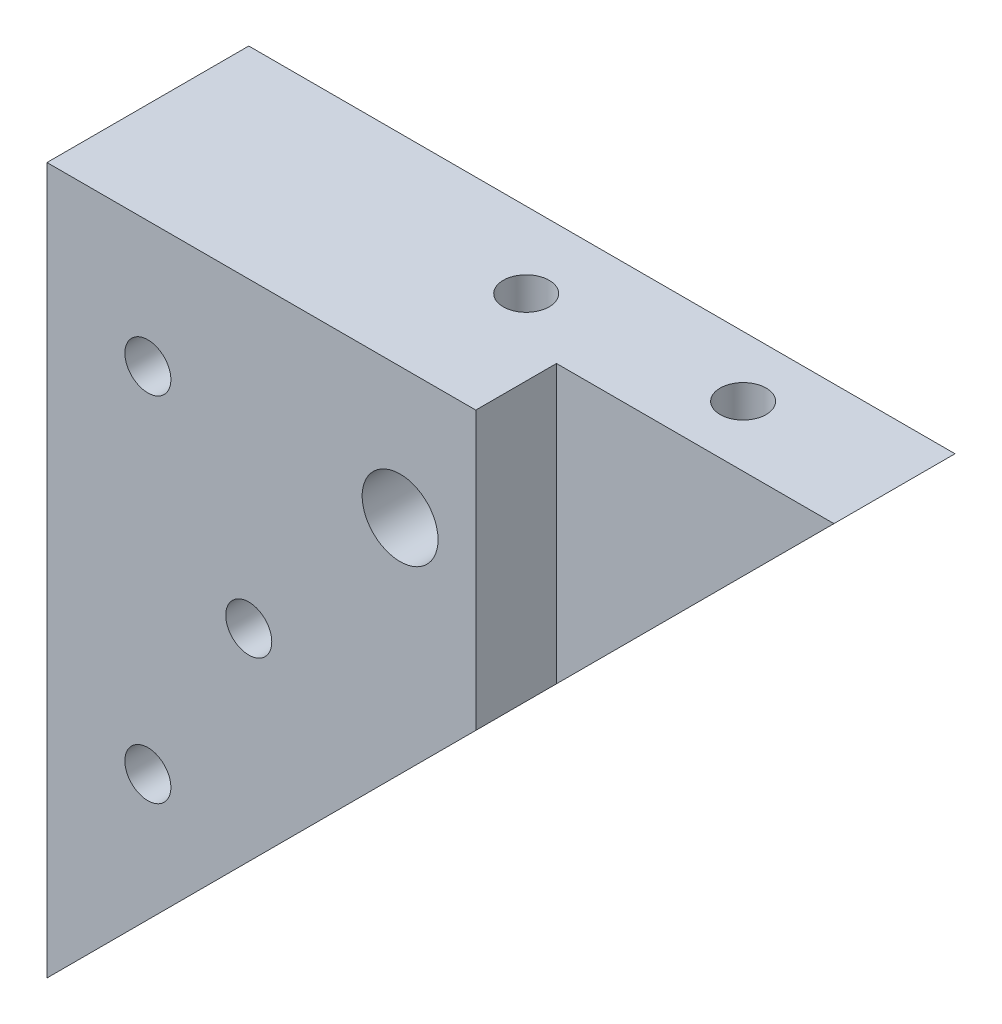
from build123d import *

# Parameters (mm, degrees)
EXTRUDE1_DEPTH     = 25.4
SKETCH3_W          = 34.925
SKETCH3_H          = 10.16
CUT_EXTRUDE1_DEPTH = 129.263712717
SKETCH4_R          = 4.7752
CUT_EXTRUDE2_DEPTH = 129.263712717
SKETCH5_R          = 2.8956
CUT_EXTRUDE3_DEPTH = 129.263712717
CUT_EXTRUDE4_START = -12.7
SKETCH6_R          = 6.6294
CUT_EXTRUDE4_DEPTH = 19.05
SKETCH7_R          = 2.8956
CUT_EXTRUDE5_DEPTH = 129.263712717
CHAMFER1_SIZE      = 2.032
CHAMFER1_SIZE2     = 1.766390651
SKETCH9_R          = 2.8956
CUT_EXTRUDE7_DEPTH = 25.4


with BuildPart() as part:
    # Sketch2 → Extrude1 (new body)
    with BuildSketch(Plane.XY):
        Polygon((0, 88.9), (0, 0), (88.9, 88.9), align=None)
    extrude(amount=EXTRUDE1_DEPTH)

    # Sketch3 → Cut-Extrude1 (cut, through all)
    with BuildSketch(Plane(origin=(0, 88.9, 0), x_dir=(-1, 0, 0), z_dir=(0, 1, 0))):
        with Locations((-71.4375, 5.08)):
            Rectangle(SKETCH3_W, SKETCH3_H)
    extrude(amount=-CUT_EXTRUDE1_DEPTH, mode=Mode.SUBTRACT)

    # Sketch4 → Cut-Extrude2 (cut, through all)
    with BuildSketch(Plane.XY.offset(25.4)):
        with Locations((44.45, 72.39)):
            Circle(SKETCH4_R)
    extrude(amount=-CUT_EXTRUDE2_DEPTH, mode=Mode.SUBTRACT)

    # Sketch5 → Cut-Extrude3 (cut, through all)
    with BuildSketch(Plane(origin=(0, 88.9, 0), x_dir=(-1, 0, 0), z_dir=(0, 1, 0))):
        with Locations((-69.85, 17.78)):
            Circle(SKETCH5_R)
    extrude(amount=-CUT_EXTRUDE3_DEPTH, mode=Mode.SUBTRACT)

    # Sketch6 → Cut-Extrude4 (cut)
    with BuildSketch(Plane(origin=(0, 88.9, 0), x_dir=(-1, 0, 0), z_dir=(0, 1, 0)).offset(CUT_EXTRUDE4_START)):
        with Locations((-69.85, 17.78)):
            Circle(SKETCH6_R)
    extrude(amount=-CUT_EXTRUDE4_DEPTH, mode=Mode.SUBTRACT)

    # Sketch7 → Cut-Extrude5 (cut, through all)
    with BuildSketch(Plane.XY.offset(25.4)):
        with Locations((12.7, 73.025)):
            Circle(SKETCH7_R)
        with Locations((12.7, 28.575)):
            Circle(SKETCH7_R)
        with Locations((25.4, 50.8)):
            Circle(SKETCH7_R)
    extrude(amount=-CUT_EXTRUDE5_DEPTH, mode=Mode.SUBTRACT)

    # Chamfer1
    chamfer1_edges = [part.edges().sort_by_distance(p)[0] for p in [
        (9.8044, 73.025, 25.4),
        (9.8044, 28.575, 25.4),
        (22.5044, 50.8, 25.4),
    ]]
    chamfer1_side = [part.faces().sort_by_distance(p)[0] for p in [
        (29.618118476, 59.195354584, 25.4),
    ]]
    chamfer(chamfer1_edges, length=CHAMFER1_SIZE, length2=CHAMFER1_SIZE2, reference=chamfer1_side[0])

    # Sketch9 → Cut-Extrude7 (cut)
    with BuildSketch(Plane(origin=(0, 88.9, 0), x_dir=(-1, 0, 0), z_dir=(0, 1, 0))):
        with Locations((-44.45, 15.875)):
            Circle(SKETCH9_R)
    extrude(amount=-CUT_EXTRUDE7_DEPTH, mode=Mode.SUBTRACT)


with BuildPart() as body_2:
    # Mirror1: mirrored copy
    add(part.part.mirror(Plane(origin=(0, 88.9, 0), x_dir=(1, 0, 0), z_dir=(0, 0, 1))))


solid = body_2.part
